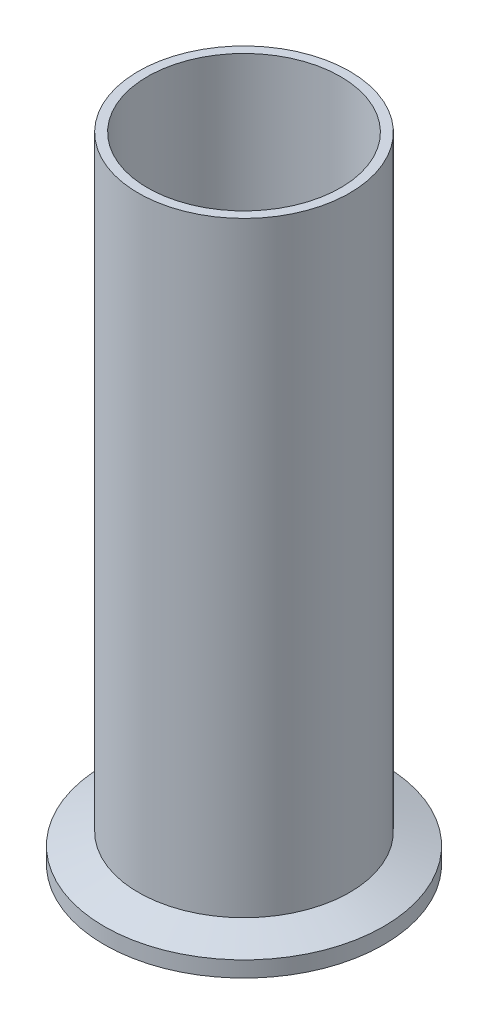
from build123d import *


with BuildPart() as part:
    # Sketch1 → Revolve2 (revolve)
    with BuildSketch(Plane.XY, mode=Mode.PRIVATE) as revolve2_sk:
        with BuildLine():
            Line((-17.399, 0), (-17.399, 114.3))
            Line((-17.399, 114.3), (-19.05, 114.3))
            Line((-19.05, 114.3), (-19.05, 5.082052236))
            Line((-19.05, 5.082052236), (-25.1968, 2.8448))
            Line((-25.1968, 2.8448), (-25.1968, 0))
            Line((-25.1968, 0), (-23.636608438, 0))
            ThreePointArc((-23.636608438, 0), (-23.204411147, 0.129217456), (-22.914066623, 0.474458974))
            ThreePointArc((-22.914066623, 0.474458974), (-21.8186, 1.1938), (-20.723133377, 0.474458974))
            ThreePointArc((-20.723133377, 0.474458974), (-20.432788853, 0.129217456), (-20.000591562, 0))
            Line((-20.000591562, 0), (-17.399, 0))
        make_face()
    revolve(revolve2_sk.sketch.rotate(Axis((0, 0, 0), (0, 1, 0)), 270), axis=Axis((0, 0, 0), (0, 1, 0)))


solid = part.part
